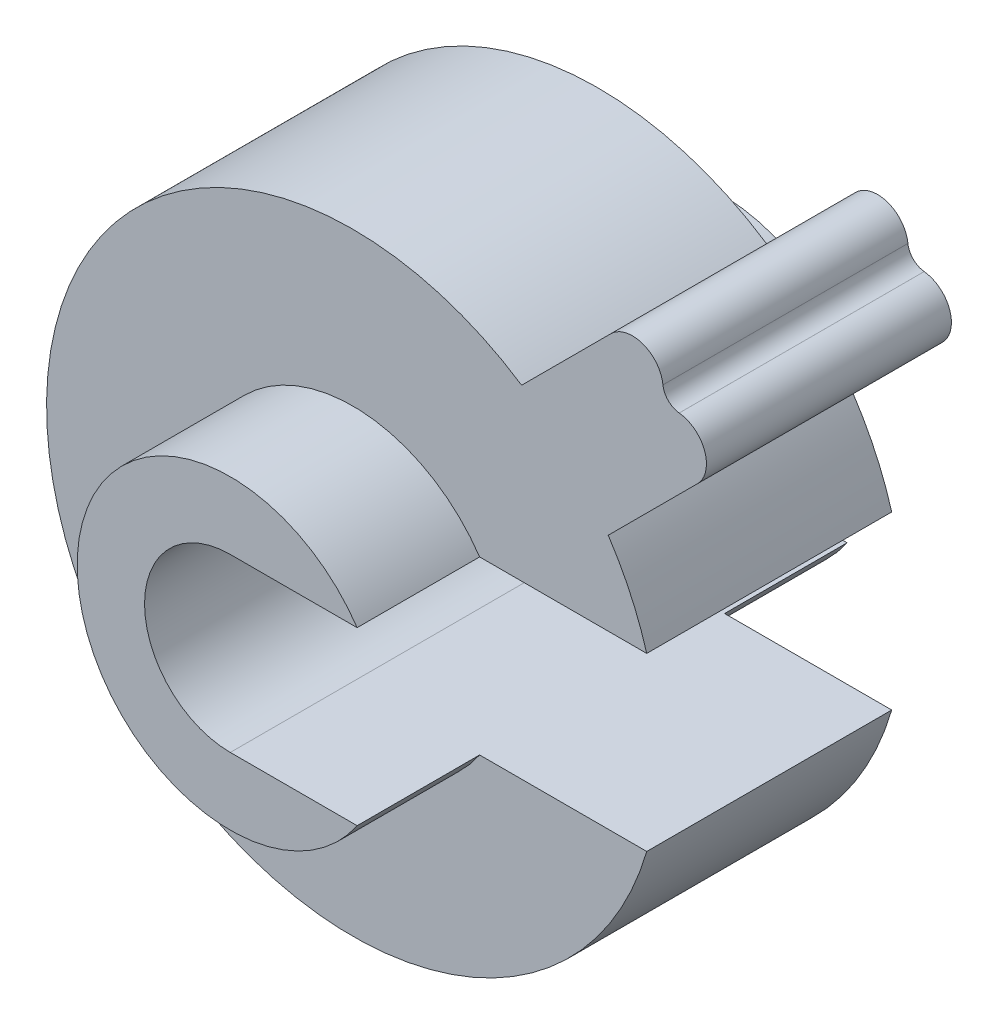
ISO-10303-21;
HEADER;
FILE_DESCRIPTION(('STEP AP214'),'2;1');
FILE_NAME('part.step','',(''),(''),'','','');
FILE_SCHEMA(('AUTOMOTIVE_DESIGN { 1 0 10303 214 1 1 1 1 }'));
ENDSEC;
DATA;
#1=APPLICATION_CONTEXT('core data for automotive mechanical design processes');
#2=APPLICATION_PROTOCOL_DEFINITION('international standard','automotive_design',2000,#1);
#3=PRODUCT_CONTEXT('',#1,'mechanical');
#4=PRODUCT('Part','Part','',(#3));
#5=PRODUCT_RELATED_PRODUCT_CATEGORY('part','',(#4));
#6=PRODUCT_DEFINITION_FORMATION('','',#4);
#7=PRODUCT_DEFINITION_CONTEXT('part definition',#1,'design');
#8=PRODUCT_DEFINITION('design','',#6,#7);
#9=PRODUCT_DEFINITION_SHAPE('','',#8);
#10=(LENGTH_UNIT() NAMED_UNIT(*) SI_UNIT(.MILLI.,.METRE.));
#11=(NAMED_UNIT(*) PLANE_ANGLE_UNIT() SI_UNIT($,.RADIAN.));
#12=(NAMED_UNIT(*) SI_UNIT($,.STERADIAN.) SOLID_ANGLE_UNIT());
#13=UNCERTAINTY_MEASURE_WITH_UNIT(LENGTH_MEASURE(1.E-05),#10,'distance_accuracy_value','');
#14=(GEOMETRIC_REPRESENTATION_CONTEXT(3) GLOBAL_UNCERTAINTY_ASSIGNED_CONTEXT((#13)) GLOBAL_UNIT_ASSIGNED_CONTEXT((#10,
#11,#12)) REPRESENTATION_CONTEXT('',''));
#15=CARTESIAN_POINT('',(0.,0.,0.));
#16=DIRECTION('',(0.,0.,1.));
#17=DIRECTION('',(1.,0.,0.));
#18=AXIS2_PLACEMENT_3D('',#15,#16,#17);
#19=CARTESIAN_POINT('',(0.,0.,1.));
#20=DIRECTION('',(0.,0.,-1.));
#21=DIRECTION('',(-1.,0.,0.));
#22=AXIS2_PLACEMENT_3D('',#19,#20,#21);
#23=CYLINDRICAL_SURFACE('',#22,2.5);
#24=CARTESIAN_POINT('',(0.,0.,-1.));
#25=DIRECTION('',(0.,0.,1.));
#26=DIRECTION('',(1.,0.,0.));
#27=AXIS2_PLACEMENT_3D('',#24,#25,#26);
#28=CIRCLE('',#27,2.5);
#29=CARTESIAN_POINT('',(2.4,0.7,-1.));
#30=VERTEX_POINT('',#29);
#31=CARTESIAN_POINT('',(2.08560419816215,1.37849741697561,-1.));
#32=VERTEX_POINT('',#31);
#33=EDGE_CURVE('E173',#30,#32,#28,.T.);
#34=ORIENTED_EDGE('',*,*,#33,.T.);
#35=DIRECTION('',(0.,0.,-1.));
#36=VECTOR('',#35,1.);
#37=CARTESIAN_POINT('',(2.08560419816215,1.37849741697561,1.));
#38=LINE('',#37,#36);
#39=CARTESIAN_POINT('',(2.08560419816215,1.37849741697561,1.));
#40=VERTEX_POINT('',#39);
#41=EDGE_CURVE('E165',#32,#40,#38,.F.);
#42=ORIENTED_EDGE('',*,*,#41,.T.);
#43=CARTESIAN_POINT('',(0.,0.,1.));
#44=DIRECTION('',(0.,0.,1.));
#45=DIRECTION('',(1.,0.,0.));
#46=AXIS2_PLACEMENT_3D('',#43,#44,#45);
#47=CIRCLE('',#46,2.5);
#48=CARTESIAN_POINT('',(2.4,0.7,1.));
#49=VERTEX_POINT('',#48);
#50=EDGE_CURVE('E182',#49,#40,#47,.T.);
#51=ORIENTED_EDGE('',*,*,#50,.F.);
#52=DIRECTION('',(0.,0.,-1.));
#53=VECTOR('',#52,1.);
#54=CARTESIAN_POINT('',(2.4,0.7,1.));
#55=LINE('',#54,#53);
#56=EDGE_CURVE('E268',#49,#30,#55,.T.);
#57=ORIENTED_EDGE('',*,*,#56,.T.);
#58=EDGE_LOOP('',(#34,#42,#51,#57));
#59=FACE_BOUND('',#58,.T.);
#60=ADVANCED_FACE('F33',(#59),#23,.T.);
#61=CARTESIAN_POINT('',(0.,0.,-2.5));
#62=DIRECTION('',(0.,0.,1.));
#63=DIRECTION('',(1.,0.,0.));
#64=AXIS2_PLACEMENT_3D('',#61,#62,#63);
#65=CYLINDRICAL_SURFACE('',#64,0.7);
#66=DIRECTION('',(0.,0.,1.));
#67=VECTOR('',#66,1.);
#68=CARTESIAN_POINT('',(0.,0.7,-2.5));
#69=LINE('',#68,#67);
#70=CARTESIAN_POINT('',(0.,0.7,2.));
#71=VERTEX_POINT('',#70);
#72=CARTESIAN_POINT('',(0.,0.7,-2.));
#73=VERTEX_POINT('',#72);
#74=EDGE_CURVE('E198',#71,#73,#69,.F.);
#75=ORIENTED_EDGE('',*,*,#74,.F.);
#76=CARTESIAN_POINT('',(0.,0.,2.));
#77=DIRECTION('',(0.,0.,1.));
#78=DIRECTION('',(1.,0.,0.));
#79=AXIS2_PLACEMENT_3D('',#76,#77,#78);
#80=CIRCLE('',#79,0.7);
#81=CARTESIAN_POINT('',(0.,-0.7,2.));
#82=VERTEX_POINT('',#81);
#83=EDGE_CURVE('E178',#71,#82,#80,.T.);
#84=ORIENTED_EDGE('',*,*,#83,.T.);
#85=DIRECTION('',(0.,0.,1.));
#86=VECTOR('',#85,1.);
#87=CARTESIAN_POINT('',(0.,-0.7,-2.5));
#88=LINE('',#87,#86);
#89=CARTESIAN_POINT('',(0.,-0.7,-2.));
#90=VERTEX_POINT('',#89);
#91=EDGE_CURVE('E193',#82,#90,#88,.F.);
#92=ORIENTED_EDGE('',*,*,#91,.T.);
#93=CARTESIAN_POINT('',(0.,0.,-2.));
#94=DIRECTION('',(0.,0.,1.));
#95=DIRECTION('',(1.,0.,0.));
#96=AXIS2_PLACEMENT_3D('',#93,#94,#95);
#97=CIRCLE('',#96,0.7);
#98=EDGE_CURVE('E174',#73,#90,#97,.T.);
#99=ORIENTED_EDGE('',*,*,#98,.F.);
#100=EDGE_LOOP('',(#75,#84,#92,#99));
#101=FACE_BOUND('',#100,.T.);
#102=ADVANCED_FACE('F279',(#101),#65,.F.);
#103=CARTESIAN_POINT('',(0.,0.,2.));
#104=DIRECTION('',(0.,0.,-1.));
#105=DIRECTION('',(-1.,0.,0.));
#106=AXIS2_PLACEMENT_3D('',#103,#104,#105);
#107=CYLINDRICAL_SURFACE('',#106,1.25);
#108=CARTESIAN_POINT('',(0.,0.,2.));
#109=DIRECTION('',(0.,0.,1.));
#110=DIRECTION('',(1.,0.,0.));
#111=AXIS2_PLACEMENT_3D('',#108,#109,#110);
#112=CIRCLE('',#111,1.25);
#113=CARTESIAN_POINT('',(1.0356157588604,0.7,2.));
#114=VERTEX_POINT('',#113);
#115=CARTESIAN_POINT('',(1.0356157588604,-0.7,2.));
#116=VERTEX_POINT('',#115);
#117=EDGE_CURVE('E184',#114,#116,#112,.T.);
#118=ORIENTED_EDGE('',*,*,#117,.F.);
#119=DIRECTION('',(0.,0.,-1.));
#120=VECTOR('',#119,1.);
#121=CARTESIAN_POINT('',(1.0356157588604,0.7,2.));
#122=LINE('',#121,#120);
#123=CARTESIAN_POINT('',(1.0356157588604,0.7,1.));
#124=VERTEX_POINT('',#123);
#125=EDGE_CURVE('E273',#114,#124,#122,.T.);
#126=ORIENTED_EDGE('',*,*,#125,.T.);
#127=CARTESIAN_POINT('',(0.,0.,1.));
#128=DIRECTION('',(0.,0.,1.));
#129=DIRECTION('',(1.,0.,0.));
#130=AXIS2_PLACEMENT_3D('',#127,#128,#129);
#131=CIRCLE('',#130,1.25);
#132=CARTESIAN_POINT('',(1.0356157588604,-0.7,1.));
#133=VERTEX_POINT('',#132);
#134=EDGE_CURVE('E191',#124,#133,#131,.T.);
#135=ORIENTED_EDGE('',*,*,#134,.T.);
#136=DIRECTION('',(0.,0.,-1.));
#137=VECTOR('',#136,1.);
#138=CARTESIAN_POINT('',(1.0356157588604,-0.7,2.));
#139=LINE('',#138,#137);
#140=EDGE_CURVE('E256',#133,#116,#139,.F.);
#141=ORIENTED_EDGE('',*,*,#140,.T.);
#142=EDGE_LOOP('',(#118,#126,#135,#141));
#143=FACE_BOUND('',#142,.T.);
#144=ADVANCED_FACE('F290',(#143),#107,.T.);
#145=CARTESIAN_POINT('',(0.,0.,2.));
#146=DIRECTION('',(0.,0.,1.));
#147=DIRECTION('',(1.,0.,0.));
#148=AXIS2_PLACEMENT_3D('',#145,#146,#147);
#149=PLANE('',#148);
#150=DIRECTION('',(-1.,0.,0.));
#151=VECTOR('',#150,1.);
#152=CARTESIAN_POINT('',(0.,0.7,2.));
#153=LINE('',#152,#151);
#154=EDGE_CURVE('E242',#114,#71,#153,.T.);
#155=ORIENTED_EDGE('',*,*,#154,.F.);
#156=ORIENTED_EDGE('',*,*,#117,.T.);
#157=DIRECTION('',(1.,0.,0.));
#158=VECTOR('',#157,1.);
#159=CARTESIAN_POINT('',(2.70440013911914,-0.7,2.));
#160=LINE('',#159,#158);
#161=EDGE_CURVE('E240',#82,#116,#160,.T.);
#162=ORIENTED_EDGE('',*,*,#161,.F.);
#163=ORIENTED_EDGE('',*,*,#83,.F.);
#164=EDGE_LOOP('',(#155,#156,#162,#163));
#165=FACE_BOUND('',#164,.T.);
#166=ADVANCED_FACE('F284',(#165),#149,.T.);
#167=CARTESIAN_POINT('',(1.3784974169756,2.08560419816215,1.));
#168=VERTEX_POINT('',#167);
#169=CARTESIAN_POINT('',(2.4,-0.7,1.));
#170=VERTEX_POINT('',#169);
#171=EDGE_CURVE('E164',#168,#170,#47,.T.);
#172=ORIENTED_EDGE('',*,*,#171,.F.);
#173=DIRECTION('',(0.,0.,-1.));
#174=VECTOR('',#173,1.);
#175=CARTESIAN_POINT('',(1.3784974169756,2.08560419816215,1.));
#176=LINE('',#175,#174);
#177=CARTESIAN_POINT('',(1.3784974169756,2.08560419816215,-1.));
#178=VERTEX_POINT('',#177);
#179=EDGE_CURVE('E148',#168,#178,#176,.T.);
#180=ORIENTED_EDGE('',*,*,#179,.T.);
#181=CARTESIAN_POINT('',(2.4,-0.7,-1.));
#182=VERTEX_POINT('',#181);
#183=EDGE_CURVE('E162',#178,#182,#28,.T.);
#184=ORIENTED_EDGE('',*,*,#183,.T.);
#185=DIRECTION('',(0.,0.,-1.));
#186=VECTOR('',#185,1.);
#187=CARTESIAN_POINT('',(2.4,-0.7,1.));
#188=LINE('',#187,#186);
#189=EDGE_CURVE('E251',#182,#170,#188,.F.);
#190=ORIENTED_EDGE('',*,*,#189,.T.);
#191=EDGE_LOOP('',(#172,#180,#184,#190));
#192=FACE_BOUND('',#191,.T.);
#193=ADVANCED_FACE('F160',(#192),#23,.T.);
#194=CARTESIAN_POINT('',(0.,0.,1.));
#195=DIRECTION('',(0.,0.,1.));
#196=DIRECTION('',(1.,0.,0.));
#197=AXIS2_PLACEMENT_3D('',#194,#195,#196);
#198=PLANE('',#197);
#199=DIRECTION('',(0.707106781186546,0.707106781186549,0.));
#200=VECTOR('',#199,1.);
#201=CARTESIAN_POINT('',(3.18198051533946,2.47487373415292,1.));
#202=LINE('',#201,#200);
#203=CARTESIAN_POINT('',(2.81417453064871,2.10706774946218,1.));
#204=VERTEX_POINT('',#203);
#205=EDGE_CURVE('E231',#40,#204,#202,.T.);
#206=ORIENTED_EDGE('',*,*,#205,.T.);
#207=CARTESIAN_POINT('',(2.63739783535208,2.28384444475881,1.));
#208=DIRECTION('',(0.,0.,1.));
#209=DIRECTION('',(1.,0.,0.));
#210=AXIS2_PLACEMENT_3D('',#207,#208,#209);
#211=CIRCLE('',#210,0.25);
#212=CARTESIAN_POINT('',(2.66500571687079,2.53231537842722,1.));
#213=VERTEX_POINT('',#212);
#214=EDGE_CURVE('E205',#204,#213,#211,.T.);
#215=ORIENTED_EDGE('',*,*,#214,.T.);
#216=DIRECTION('',(-0.993883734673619,0.110431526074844,0.));
#217=VECTOR('',#216,1.);
#218=CARTESIAN_POINT('',(2.54558441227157,2.54558441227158,1.));
#219=LINE('',#218,#217);
#220=CARTESIAN_POINT('',(2.6648504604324,2.53233262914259,1.));
#221=VERTEX_POINT('',#220);
#222=EDGE_CURVE('E225',#213,#221,#219,.T.);
#223=ORIENTED_EDGE('',*,*,#222,.T.);
#224=CARTESIAN_POINT('',(2.68141518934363,2.68141518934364,1.));
#225=DIRECTION('',(0.,0.,1.));
#226=DIRECTION('',(1.,0.,0.));
#227=AXIS2_PLACEMENT_3D('',#224,#225,#226);
#228=CIRCLE('',#227,0.15);
#229=CARTESIAN_POINT('',(2.53233262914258,2.66485046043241,1.));
#230=VERTEX_POINT('',#229);
#231=EDGE_CURVE('E41',#221,#230,#228,.F.);
#232=ORIENTED_EDGE('',*,*,#231,.T.);
#233=DIRECTION('',(-0.110431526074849,0.993883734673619,0.));
#234=VECTOR('',#233,1.);
#235=CARTESIAN_POINT('',(2.47487373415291,3.18198051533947,1.));
#236=LINE('',#235,#234);
#237=CARTESIAN_POINT('',(2.53231537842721,2.6650057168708,1.));
#238=VERTEX_POINT('',#237);
#239=EDGE_CURVE('E314',#230,#238,#236,.T.);
#240=ORIENTED_EDGE('',*,*,#239,.T.);
#241=CARTESIAN_POINT('',(2.2838444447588,2.63739783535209,1.));
#242=DIRECTION('',(0.,0.,1.));
#243=DIRECTION('',(1.,0.,0.));
#244=AXIS2_PLACEMENT_3D('',#241,#242,#243);
#245=CIRCLE('',#244,0.25);
#246=CARTESIAN_POINT('',(2.10706774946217,2.81417453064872,1.));
#247=VERTEX_POINT('',#246);
#248=EDGE_CURVE('E203',#238,#247,#245,.T.);
#249=ORIENTED_EDGE('',*,*,#248,.T.);
#250=DIRECTION('',(-0.707106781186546,-0.707106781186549,0.));
#251=VECTOR('',#250,1.);
#252=CARTESIAN_POINT('',(2.47487373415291,3.18198051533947,1.));
#253=LINE('',#252,#251);
#254=EDGE_CURVE('E234',#247,#168,#253,.T.);
#255=ORIENTED_EDGE('',*,*,#254,.T.);
#256=ORIENTED_EDGE('',*,*,#171,.T.);
#257=DIRECTION('',(1.,0.,0.));
#258=VECTOR('',#257,1.);
#259=CARTESIAN_POINT('',(0.,-0.7,1.));
#260=LINE('',#259,#258);
#261=EDGE_CURVE('E253',#133,#170,#260,.T.);
#262=ORIENTED_EDGE('',*,*,#261,.F.);
#263=ORIENTED_EDGE('',*,*,#134,.F.);
#264=DIRECTION('',(-1.,0.,0.));
#265=VECTOR('',#264,1.);
#266=CARTESIAN_POINT('',(0.,0.7,1.));
#267=LINE('',#266,#265);
#268=EDGE_CURVE('E271',#49,#124,#267,.T.);
#269=ORIENTED_EDGE('',*,*,#268,.F.);
#270=ORIENTED_EDGE('',*,*,#50,.T.);
#271=EDGE_LOOP('',(#206,#215,#223,#232,#240,#249,#255,#256,#262,#263,#269,#270));
#272=FACE_BOUND('',#271,.T.);
#273=ADVANCED_FACE('F230',(#272),#198,.T.);
#274=CARTESIAN_POINT('',(0.,0.,-1.));
#275=DIRECTION('',(0.,0.,1.));
#276=DIRECTION('',(1.,0.,0.));
#277=AXIS2_PLACEMENT_3D('',#274,#275,#276);
#278=PLANE('',#277);
#279=DIRECTION('',(-0.993883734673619,0.110431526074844,0.));
#280=VECTOR('',#279,1.);
#281=CARTESIAN_POINT('',(2.54558441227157,2.54558441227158,-1.));
#282=LINE('',#281,#280);
#283=CARTESIAN_POINT('',(2.66500571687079,2.53231537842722,-1.));
#284=VERTEX_POINT('',#283);
#285=CARTESIAN_POINT('',(2.6648504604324,2.53233262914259,-1.));
#286=VERTEX_POINT('',#285);
#287=EDGE_CURVE('E166',#284,#286,#282,.T.);
#288=ORIENTED_EDGE('',*,*,#287,.F.);
#289=CARTESIAN_POINT('',(2.63739783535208,2.28384444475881,-1.));
#290=DIRECTION('',(0.,0.,1.));
#291=DIRECTION('',(1.,0.,0.));
#292=AXIS2_PLACEMENT_3D('',#289,#290,#291);
#293=CIRCLE('',#292,0.25);
#294=CARTESIAN_POINT('',(2.81417453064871,2.10706774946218,-1.));
#295=VERTEX_POINT('',#294);
#296=EDGE_CURVE('E211',#284,#295,#293,.F.);
#297=ORIENTED_EDGE('',*,*,#296,.T.);
#298=DIRECTION('',(0.707106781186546,0.707106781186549,0.));
#299=VECTOR('',#298,1.);
#300=CARTESIAN_POINT('',(3.18198051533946,2.47487373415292,-1.));
#301=LINE('',#300,#299);
#302=EDGE_CURVE('E156',#32,#295,#301,.T.);
#303=ORIENTED_EDGE('',*,*,#302,.F.);
#304=ORIENTED_EDGE('',*,*,#33,.F.);
#305=DIRECTION('',(-1.,0.,0.));
#306=VECTOR('',#305,1.);
#307=CARTESIAN_POINT('',(0.,0.7,-1.));
#308=LINE('',#307,#306);
#309=CARTESIAN_POINT('',(1.0356157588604,0.7,-1.));
#310=VERTEX_POINT('',#309);
#311=EDGE_CURVE('E265',#30,#310,#308,.T.);
#312=ORIENTED_EDGE('',*,*,#311,.T.);
#313=CARTESIAN_POINT('',(0.,0.,-1.));
#314=DIRECTION('',(0.,0.,1.));
#315=DIRECTION('',(1.,0.,0.));
#316=AXIS2_PLACEMENT_3D('',#313,#314,#315);
#317=CIRCLE('',#316,1.25);
#318=CARTESIAN_POINT('',(1.0356157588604,-0.7,-1.));
#319=VERTEX_POINT('',#318);
#320=EDGE_CURVE('E187',#310,#319,#317,.T.);
#321=ORIENTED_EDGE('',*,*,#320,.T.);
#322=DIRECTION('',(1.,0.,0.));
#323=VECTOR('',#322,1.);
#324=CARTESIAN_POINT('',(0.,-0.7,-1.));
#325=LINE('',#324,#323);
#326=EDGE_CURVE('E172',#319,#182,#325,.T.);
#327=ORIENTED_EDGE('',*,*,#326,.T.);
#328=ORIENTED_EDGE('',*,*,#183,.F.);
#329=DIRECTION('',(-0.707106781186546,-0.707106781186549,0.));
#330=VECTOR('',#329,1.);
#331=CARTESIAN_POINT('',(2.47487373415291,3.18198051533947,-1.));
#332=LINE('',#331,#330);
#333=CARTESIAN_POINT('',(2.10706774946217,2.81417453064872,-1.));
#334=VERTEX_POINT('',#333);
#335=EDGE_CURVE('E144',#334,#178,#332,.T.);
#336=ORIENTED_EDGE('',*,*,#335,.F.);
#337=CARTESIAN_POINT('',(2.2838444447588,2.63739783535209,-1.));
#338=DIRECTION('',(0.,0.,1.));
#339=DIRECTION('',(1.,0.,0.));
#340=AXIS2_PLACEMENT_3D('',#337,#338,#339);
#341=CIRCLE('',#340,0.25);
#342=CARTESIAN_POINT('',(2.53231537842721,2.6650057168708,-1.));
#343=VERTEX_POINT('',#342);
#344=EDGE_CURVE('E209',#334,#343,#341,.F.);
#345=ORIENTED_EDGE('',*,*,#344,.T.);
#346=DIRECTION('',(-0.110431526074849,0.993883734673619,0.));
#347=VECTOR('',#346,1.);
#348=CARTESIAN_POINT('',(2.47487373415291,3.18198051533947,-1.));
#349=LINE('',#348,#347);
#350=CARTESIAN_POINT('',(2.53233262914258,2.66485046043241,-1.));
#351=VERTEX_POINT('',#350);
#352=EDGE_CURVE('E157',#351,#343,#349,.T.);
#353=ORIENTED_EDGE('',*,*,#352,.F.);
#354=CARTESIAN_POINT('',(2.68141518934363,2.68141518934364,-1.));
#355=DIRECTION('',(0.,0.,1.));
#356=DIRECTION('',(1.,0.,0.));
#357=AXIS2_PLACEMENT_3D('',#354,#355,#356);
#358=CIRCLE('',#357,0.15);
#359=EDGE_CURVE('E11',#351,#286,#358,.T.);
#360=ORIENTED_EDGE('',*,*,#359,.T.);
#361=EDGE_LOOP('',(#288,#297,#303,#304,#312,#321,#327,#328,#336,#345,#353,#360));
#362=FACE_BOUND('',#361,.T.);
#363=ADVANCED_FACE('F170',(#362),#278,.F.);
#364=CARTESIAN_POINT('',(0.,0.,-2.));
#365=DIRECTION('',(0.,0.,1.));
#366=DIRECTION('',(1.,0.,0.));
#367=AXIS2_PLACEMENT_3D('',#364,#365,#366);
#368=PLANE('',#367);
#369=CARTESIAN_POINT('',(0.,0.,-2.));
#370=DIRECTION('',(0.,0.,1.));
#371=DIRECTION('',(1.,0.,0.));
#372=AXIS2_PLACEMENT_3D('',#369,#370,#371);
#373=CIRCLE('',#372,1.25);
#374=CARTESIAN_POINT('',(1.0356157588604,0.7,-2.));
#375=VERTEX_POINT('',#374);
#376=CARTESIAN_POINT('',(1.0356157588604,-0.7,-2.));
#377=VERTEX_POINT('',#376);
#378=EDGE_CURVE('E188',#375,#377,#373,.T.);
#379=ORIENTED_EDGE('',*,*,#378,.F.);
#380=DIRECTION('',(-1.,0.,0.));
#381=VECTOR('',#380,1.);
#382=CARTESIAN_POINT('',(0.,0.7,-2.));
#383=LINE('',#382,#381);
#384=EDGE_CURVE('E262',#375,#73,#383,.T.);
#385=ORIENTED_EDGE('',*,*,#384,.T.);
#386=ORIENTED_EDGE('',*,*,#98,.T.);
#387=DIRECTION('',(1.,0.,0.));
#388=VECTOR('',#387,1.);
#389=CARTESIAN_POINT('',(0.,-0.7,-2.));
#390=LINE('',#389,#388);
#391=EDGE_CURVE('E247',#90,#377,#390,.T.);
#392=ORIENTED_EDGE('',*,*,#391,.T.);
#393=EDGE_LOOP('',(#379,#385,#386,#392));
#394=FACE_BOUND('',#393,.T.);
#395=ADVANCED_FACE('F342',(#394),#368,.F.);
#396=ORIENTED_EDGE('',*,*,#320,.F.);
#397=DIRECTION('',(0.,0.,-1.));
#398=VECTOR('',#397,1.);
#399=CARTESIAN_POINT('',(1.0356157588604,0.7,2.));
#400=LINE('',#399,#398);
#401=EDGE_CURVE('E259',#310,#375,#400,.T.);
#402=ORIENTED_EDGE('',*,*,#401,.T.);
#403=ORIENTED_EDGE('',*,*,#378,.T.);
#404=DIRECTION('',(0.,0.,-1.));
#405=VECTOR('',#404,1.);
#406=CARTESIAN_POINT('',(1.0356157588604,-0.7,2.));
#407=LINE('',#406,#405);
#408=EDGE_CURVE('E244',#377,#319,#407,.F.);
#409=ORIENTED_EDGE('',*,*,#408,.T.);
#410=EDGE_LOOP('',(#396,#402,#403,#409));
#411=FACE_BOUND('',#410,.T.);
#412=ADVANCED_FACE('F297',(#411),#107,.T.);
#413=CARTESIAN_POINT('',(2.70440013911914,-0.7,-2.5));
#414=DIRECTION('',(0.,-1.,0.));
#415=DIRECTION('',(0.,0.,-1.));
#416=AXIS2_PLACEMENT_3D('',#413,#414,#415);
#417=PLANE('',#416);
#418=ORIENTED_EDGE('',*,*,#261,.T.);
#419=ORIENTED_EDGE('',*,*,#189,.F.);
#420=ORIENTED_EDGE('',*,*,#326,.F.);
#421=ORIENTED_EDGE('',*,*,#408,.F.);
#422=ORIENTED_EDGE('',*,*,#391,.F.);
#423=ORIENTED_EDGE('',*,*,#91,.F.);
#424=ORIENTED_EDGE('',*,*,#161,.T.);
#425=ORIENTED_EDGE('',*,*,#140,.F.);
#426=EDGE_LOOP('',(#418,#419,#420,#421,#422,#423,#424,#425));
#427=FACE_BOUND('',#426,.T.);
#428=ADVANCED_FACE('F287',(#427),#417,.F.);
#429=CARTESIAN_POINT('',(0.,0.7,-2.5));
#430=DIRECTION('',(0.,1.,0.));
#431=DIRECTION('',(0.,0.,1.));
#432=AXIS2_PLACEMENT_3D('',#429,#430,#431);
#433=PLANE('',#432);
#434=ORIENTED_EDGE('',*,*,#154,.T.);
#435=ORIENTED_EDGE('',*,*,#74,.T.);
#436=ORIENTED_EDGE('',*,*,#384,.F.);
#437=ORIENTED_EDGE('',*,*,#401,.F.);
#438=ORIENTED_EDGE('',*,*,#311,.F.);
#439=ORIENTED_EDGE('',*,*,#56,.F.);
#440=ORIENTED_EDGE('',*,*,#268,.T.);
#441=ORIENTED_EDGE('',*,*,#125,.F.);
#442=EDGE_LOOP('',(#434,#435,#436,#437,#438,#439,#440,#441));
#443=FACE_BOUND('',#442,.T.);
#444=ADVANCED_FACE('F302',(#443),#433,.F.);
#445=CARTESIAN_POINT('',(3.18198051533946,2.47487373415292,-1.));
#446=DIRECTION('',(0.707106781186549,-0.707106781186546,0.));
#447=DIRECTION('',(0.707106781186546,0.707106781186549,0.));
#448=AXIS2_PLACEMENT_3D('',#445,#446,#447);
#449=PLANE('',#448);
#450=ORIENTED_EDGE('',*,*,#302,.T.);
#451=DIRECTION('',(0.,0.,1.));
#452=VECTOR('',#451,1.);
#453=CARTESIAN_POINT('',(2.81417453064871,2.10706774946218,-1.));
#454=LINE('',#453,#452);
#455=EDGE_CURVE('E200',#295,#204,#454,.T.);
#456=ORIENTED_EDGE('',*,*,#455,.T.);
#457=ORIENTED_EDGE('',*,*,#205,.F.);
#458=ORIENTED_EDGE('',*,*,#41,.F.);
#459=EDGE_LOOP('',(#450,#456,#457,#458));
#460=FACE_BOUND('',#459,.T.);
#461=ADVANCED_FACE('F306',(#460),#449,.T.);
#462=CARTESIAN_POINT('',(2.47487373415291,3.18198051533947,-1.));
#463=DIRECTION('',(-0.707106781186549,0.707106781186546,0.));
#464=DIRECTION('',(-0.707106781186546,-0.707106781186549,0.));
#465=AXIS2_PLACEMENT_3D('',#462,#463,#464);
#466=PLANE('',#465);
#467=ORIENTED_EDGE('',*,*,#254,.F.);
#468=DIRECTION('',(0.,0.,1.));
#469=VECTOR('',#468,1.);
#470=CARTESIAN_POINT('',(2.10706774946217,2.81417453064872,-1.));
#471=LINE('',#470,#469);
#472=EDGE_CURVE('E151',#247,#334,#471,.F.);
#473=ORIENTED_EDGE('',*,*,#472,.T.);
#474=ORIENTED_EDGE('',*,*,#335,.T.);
#475=ORIENTED_EDGE('',*,*,#179,.F.);
#476=EDGE_LOOP('',(#467,#473,#474,#475));
#477=FACE_BOUND('',#476,.T.);
#478=ADVANCED_FACE('F147',(#477),#466,.T.);
#479=CARTESIAN_POINT('',(2.47487373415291,3.18198051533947,-1.));
#480=DIRECTION('',(0.993883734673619,0.110431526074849,0.));
#481=DIRECTION('',(-0.110431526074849,0.993883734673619,0.));
#482=AXIS2_PLACEMENT_3D('',#479,#480,#481);
#483=PLANE('',#482);
#484=ORIENTED_EDGE('',*,*,#239,.F.);
#485=DIRECTION('',(0.,0.,1.));
#486=VECTOR('',#485,1.);
#487=CARTESIAN_POINT('',(2.53233262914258,2.66485046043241,-1.));
#488=LINE('',#487,#486);
#489=EDGE_CURVE('E54',#230,#351,#488,.F.);
#490=ORIENTED_EDGE('',*,*,#489,.T.);
#491=ORIENTED_EDGE('',*,*,#352,.T.);
#492=DIRECTION('',(0.,0.,1.));
#493=VECTOR('',#492,1.);
#494=CARTESIAN_POINT('',(2.53231537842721,2.6650057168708,-1.));
#495=LINE('',#494,#493);
#496=EDGE_CURVE('E213',#343,#238,#495,.T.);
#497=ORIENTED_EDGE('',*,*,#496,.T.);
#498=EDGE_LOOP('',(#484,#490,#491,#497));
#499=FACE_BOUND('',#498,.T.);
#500=ADVANCED_FACE('F350',(#499),#483,.T.);
#501=CARTESIAN_POINT('',(2.54558441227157,2.54558441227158,-1.));
#502=DIRECTION('',(0.110431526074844,0.993883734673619,0.));
#503=DIRECTION('',(-0.993883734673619,0.110431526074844,0.));
#504=AXIS2_PLACEMENT_3D('',#501,#502,#503);
#505=PLANE('',#504);
#506=ORIENTED_EDGE('',*,*,#287,.T.);
#507=DIRECTION('',(0.,0.,1.));
#508=VECTOR('',#507,1.);
#509=CARTESIAN_POINT('',(2.6648504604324,2.53233262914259,0.999999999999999));
#510=LINE('',#509,#508);
#511=EDGE_CURVE('E217',#286,#221,#510,.T.);
#512=ORIENTED_EDGE('',*,*,#511,.T.);
#513=ORIENTED_EDGE('',*,*,#222,.F.);
#514=DIRECTION('',(0.,0.,1.));
#515=VECTOR('',#514,1.);
#516=CARTESIAN_POINT('',(2.66500571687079,2.53231537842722,-1.));
#517=LINE('',#516,#515);
#518=EDGE_CURVE('E207',#213,#284,#517,.F.);
#519=ORIENTED_EDGE('',*,*,#518,.T.);
#520=EDGE_LOOP('',(#506,#512,#513,#519));
#521=FACE_BOUND('',#520,.T.);
#522=ADVANCED_FACE('F224',(#521),#505,.T.);
#523=CARTESIAN_POINT('',(2.63739783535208,2.28384444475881,-1.));
#524=DIRECTION('',(0.,0.,1.));
#525=DIRECTION('',(1.,0.,0.));
#526=AXIS2_PLACEMENT_3D('',#523,#524,#525);
#527=CYLINDRICAL_SURFACE('',#526,0.25);
#528=ORIENTED_EDGE('',*,*,#296,.F.);
#529=ORIENTED_EDGE('',*,*,#518,.F.);
#530=ORIENTED_EDGE('',*,*,#214,.F.);
#531=ORIENTED_EDGE('',*,*,#455,.F.);
#532=EDGE_LOOP('',(#528,#529,#530,#531));
#533=FACE_BOUND('',#532,.T.);
#534=ADVANCED_FACE('F310',(#533),#527,.T.);
#535=CARTESIAN_POINT('',(2.2838444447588,2.63739783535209,-1.));
#536=DIRECTION('',(0.,0.,1.));
#537=DIRECTION('',(1.,0.,0.));
#538=AXIS2_PLACEMENT_3D('',#535,#536,#537);
#539=CYLINDRICAL_SURFACE('',#538,0.25);
#540=ORIENTED_EDGE('',*,*,#344,.F.);
#541=ORIENTED_EDGE('',*,*,#472,.F.);
#542=ORIENTED_EDGE('',*,*,#248,.F.);
#543=ORIENTED_EDGE('',*,*,#496,.F.);
#544=EDGE_LOOP('',(#540,#541,#542,#543));
#545=FACE_BOUND('',#544,.T.);
#546=ADVANCED_FACE('F317',(#545),#539,.T.);
#547=CARTESIAN_POINT('',(2.68141518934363,2.68141518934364,-1.));
#548=DIRECTION('',(0.,0.,-1.));
#549=DIRECTION('',(-1.,0.,0.));
#550=AXIS2_PLACEMENT_3D('',#547,#548,#549);
#551=CYLINDRICAL_SURFACE('',#550,0.15);
#552=ORIENTED_EDGE('',*,*,#359,.F.);
#553=ORIENTED_EDGE('',*,*,#489,.F.);
#554=ORIENTED_EDGE('',*,*,#231,.F.);
#555=ORIENTED_EDGE('',*,*,#511,.F.);
#556=EDGE_LOOP('',(#552,#553,#554,#555));
#557=FACE_BOUND('',#556,.T.);
#558=ADVANCED_FACE('F35',(#557),#551,.F.);
#559=CLOSED_SHELL('',(#60,#102,#144,#166,#193,#273,#363,#395,#412,#428,#444,#461,#478,#500,#522,
#534,#546,#558));
#560=MANIFOLD_SOLID_BREP('B2',#559);
#561=ADVANCED_BREP_SHAPE_REPRESENTATION('',(#18,#560),#14);
#562=SHAPE_DEFINITION_REPRESENTATION(#9,#561);
ENDSEC;
END-ISO-10303-21;
